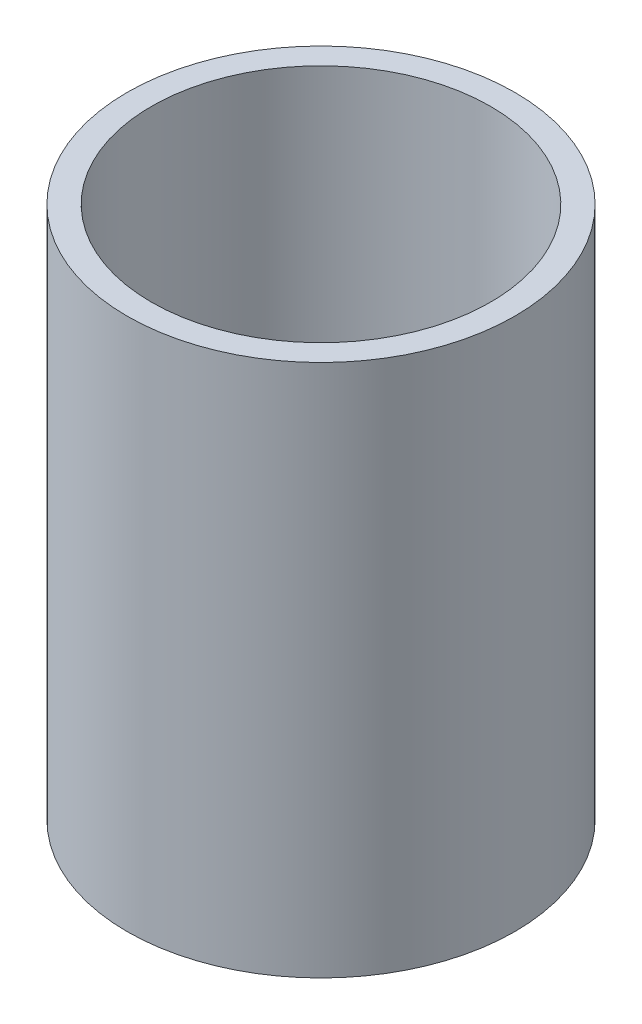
from build123d import *

# Parameters (mm, degrees)
SKETCH1_R           = 40
SKETCH1_R_2         = 35
BOSS_EXTRUDE1_DEPTH = 110


with BuildPart() as part:
    # Sketch1 → Boss-Extrude1 (new body)
    with BuildSketch(Plane(origin=(0, 0, 0), x_dir=(1, 0, 0), z_dir=(0, 1, 0))):
        with Locations(Location((0, 0, 0), (0, 0, 270))):
            Circle(SKETCH1_R)
        with Locations(Location((0, 0, 0), (0, 0, 270))):
            Circle(SKETCH1_R_2, mode=Mode.SUBTRACT)
    extrude(amount=BOSS_EXTRUDE1_DEPTH)


solid = part.part
